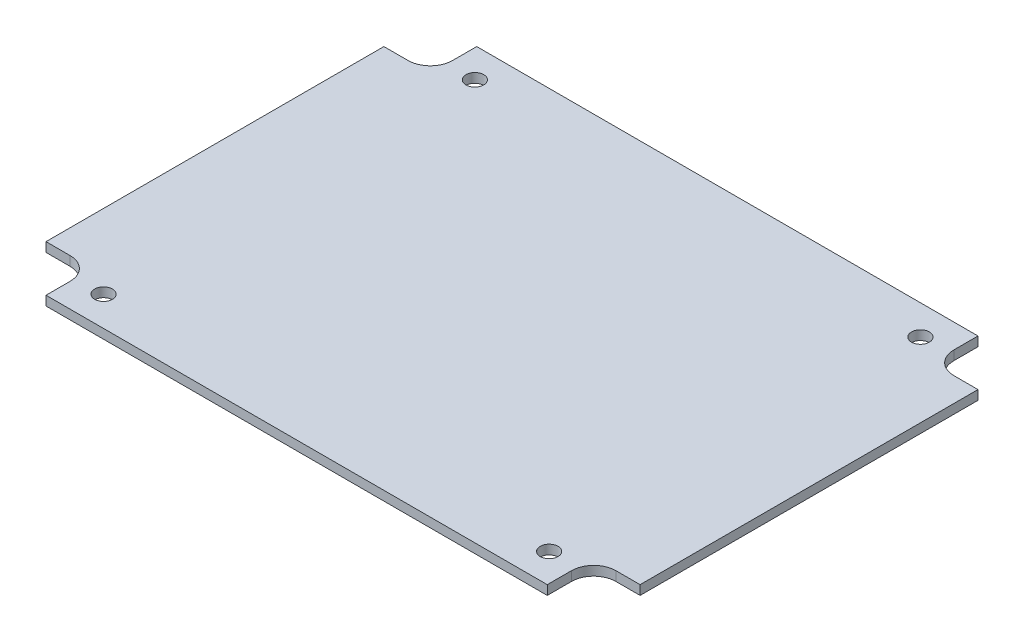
ISO-10303-21;
HEADER;
FILE_DESCRIPTION(('STEP AP214'),'2;1');
FILE_NAME('part.step','',(''),(''),'','','');
FILE_SCHEMA(('AUTOMOTIVE_DESIGN { 1 0 10303 214 1 1 1 1 }'));
ENDSEC;
DATA;
#1=APPLICATION_CONTEXT('core data for automotive mechanical design processes');
#2=APPLICATION_PROTOCOL_DEFINITION('international standard','automotive_design',2000,#1);
#3=PRODUCT_CONTEXT('',#1,'mechanical');
#4=PRODUCT('Part','Part','',(#3));
#5=PRODUCT_RELATED_PRODUCT_CATEGORY('part','',(#4));
#6=PRODUCT_DEFINITION_FORMATION('','',#4);
#7=PRODUCT_DEFINITION_CONTEXT('part definition',#1,'design');
#8=PRODUCT_DEFINITION('design','',#6,#7);
#9=PRODUCT_DEFINITION_SHAPE('','',#8);
#10=(LENGTH_UNIT() NAMED_UNIT(*) SI_UNIT(.MILLI.,.METRE.));
#11=(NAMED_UNIT(*) PLANE_ANGLE_UNIT() SI_UNIT($,.RADIAN.));
#12=(NAMED_UNIT(*) SI_UNIT($,.STERADIAN.) SOLID_ANGLE_UNIT());
#13=UNCERTAINTY_MEASURE_WITH_UNIT(LENGTH_MEASURE(1.E-05),#10,'distance_accuracy_value','');
#14=(GEOMETRIC_REPRESENTATION_CONTEXT(3) GLOBAL_UNCERTAINTY_ASSIGNED_CONTEXT((#13)) GLOBAL_UNIT_ASSIGNED_CONTEXT((#10,
#11,#12)) REPRESENTATION_CONTEXT('',''));
#15=CARTESIAN_POINT('',(0.,0.,0.));
#16=DIRECTION('',(0.,0.,1.));
#17=DIRECTION('',(1.,0.,0.));
#18=AXIS2_PLACEMENT_3D('',#15,#16,#17);
#19=CARTESIAN_POINT('',(0.,1.6002,-73.66));
#20=DIRECTION('',(0.,0.,1.));
#21=DIRECTION('',(1.,0.,0.));
#22=AXIS2_PLACEMENT_3D('',#19,#20,#21);
#23=PLANE('',#22);
#24=DIRECTION('',(-1.,0.,0.));
#25=VECTOR('',#24,1.);
#26=CARTESIAN_POINT('',(0.,0.,-73.66));
#27=LINE('',#26,#25);
#28=CARTESIAN_POINT('',(93.6625,0.,-73.66));
#29=VERTEX_POINT('',#28);
#30=CARTESIAN_POINT('',(7.93749999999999,0.,-73.66));
#31=VERTEX_POINT('',#30);
#32=EDGE_CURVE('E252',#29,#31,#27,.T.);
#33=ORIENTED_EDGE('',*,*,#32,.T.);
#34=DIRECTION('',(0.,1.,0.));
#35=VECTOR('',#34,1.);
#36=CARTESIAN_POINT('',(7.93749999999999,0.,-73.66));
#37=LINE('',#36,#35);
#38=CARTESIAN_POINT('',(7.93749999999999,1.6002,-73.66));
#39=VERTEX_POINT('',#38);
#40=EDGE_CURVE('E53',#31,#39,#37,.T.);
#41=ORIENTED_EDGE('',*,*,#40,.T.);
#42=DIRECTION('',(-1.,0.,0.));
#43=VECTOR('',#42,1.);
#44=CARTESIAN_POINT('',(0.,1.6002,-73.66));
#45=LINE('',#44,#43);
#46=CARTESIAN_POINT('',(93.6625,1.6002,-73.66));
#47=VERTEX_POINT('',#46);
#48=EDGE_CURVE('E268',#47,#39,#45,.T.);
#49=ORIENTED_EDGE('',*,*,#48,.F.);
#50=DIRECTION('',(0.,1.,0.));
#51=VECTOR('',#50,1.);
#52=CARTESIAN_POINT('',(93.6625,0.,-73.66));
#53=LINE('',#52,#51);
#54=EDGE_CURVE('E225',#29,#47,#53,.T.);
#55=ORIENTED_EDGE('',*,*,#54,.F.);
#56=EDGE_LOOP('',(#33,#41,#49,#55));
#57=FACE_BOUND('',#56,.T.);
#58=ADVANCED_FACE('F31',(#57),#23,.F.);
#59=CARTESIAN_POINT('',(0.,1.6002,0.));
#60=DIRECTION('',(1.,0.,0.));
#61=DIRECTION('',(0.,0.,-1.));
#62=AXIS2_PLACEMENT_3D('',#59,#60,#61);
#63=PLANE('',#62);
#64=DIRECTION('',(0.,0.,1.));
#65=VECTOR('',#64,1.);
#66=CARTESIAN_POINT('',(0.,0.,0.));
#67=LINE('',#66,#65);
#68=CARTESIAN_POINT('',(0.,0.,-65.7225));
#69=VERTEX_POINT('',#68);
#70=CARTESIAN_POINT('',(0.,0.,-7.93749999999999));
#71=VERTEX_POINT('',#70);
#72=EDGE_CURVE('E260',#69,#71,#67,.T.);
#73=ORIENTED_EDGE('',*,*,#72,.T.);
#74=DIRECTION('',(0.,1.,0.));
#75=VECTOR('',#74,1.);
#76=CARTESIAN_POINT('',(0.,0.,-7.93749999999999));
#77=LINE('',#76,#75);
#78=CARTESIAN_POINT('',(0.,1.6002,-7.93749999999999));
#79=VERTEX_POINT('',#78);
#80=EDGE_CURVE('E45',#71,#79,#77,.T.);
#81=ORIENTED_EDGE('',*,*,#80,.T.);
#82=DIRECTION('',(0.,0.,1.));
#83=VECTOR('',#82,1.);
#84=CARTESIAN_POINT('',(0.,1.6002,0.));
#85=LINE('',#84,#83);
#86=CARTESIAN_POINT('',(0.,1.6002,-65.7225));
#87=VERTEX_POINT('',#86);
#88=EDGE_CURVE('E166',#87,#79,#85,.T.);
#89=ORIENTED_EDGE('',*,*,#88,.F.);
#90=DIRECTION('',(0.,1.,0.));
#91=VECTOR('',#90,1.);
#92=CARTESIAN_POINT('',(0.,0.,-65.7225));
#93=LINE('',#92,#91);
#94=EDGE_CURVE('E201',#69,#87,#93,.T.);
#95=ORIENTED_EDGE('',*,*,#94,.F.);
#96=EDGE_LOOP('',(#73,#81,#89,#95));
#97=FACE_BOUND('',#96,.T.);
#98=ADVANCED_FACE('F318',(#97),#63,.F.);
#99=CARTESIAN_POINT('',(0.,1.6002,0.));
#100=DIRECTION('',(0.,0.,-1.));
#101=DIRECTION('',(-1.,0.,0.));
#102=AXIS2_PLACEMENT_3D('',#99,#100,#101);
#103=PLANE('',#102);
#104=DIRECTION('',(1.,0.,0.));
#105=VECTOR('',#104,1.);
#106=CARTESIAN_POINT('',(0.,1.6002,0.));
#107=LINE('',#106,#105);
#108=CARTESIAN_POINT('',(7.9375,1.6002,0.));
#109=VERTEX_POINT('',#108);
#110=CARTESIAN_POINT('',(93.6625,1.6002,0.));
#111=VERTEX_POINT('',#110);
#112=EDGE_CURVE('E38',#109,#111,#107,.T.);
#113=ORIENTED_EDGE('',*,*,#112,.F.);
#114=DIRECTION('',(0.,1.,0.));
#115=VECTOR('',#114,1.);
#116=CARTESIAN_POINT('',(7.9375,0.,0.));
#117=LINE('',#116,#115);
#118=CARTESIAN_POINT('',(7.9375,0.,0.));
#119=VERTEX_POINT('',#118);
#120=EDGE_CURVE('E179',#119,#109,#117,.T.);
#121=ORIENTED_EDGE('',*,*,#120,.F.);
#122=DIRECTION('',(1.,0.,0.));
#123=VECTOR('',#122,1.);
#124=CARTESIAN_POINT('',(0.,0.,0.));
#125=LINE('',#124,#123);
#126=CARTESIAN_POINT('',(93.6625,0.,0.));
#127=VERTEX_POINT('',#126);
#128=EDGE_CURVE('E263',#119,#127,#125,.T.);
#129=ORIENTED_EDGE('',*,*,#128,.T.);
#130=DIRECTION('',(0.,1.,0.));
#131=VECTOR('',#130,1.);
#132=CARTESIAN_POINT('',(93.6625,0.,0.));
#133=LINE('',#132,#131);
#134=EDGE_CURVE('E249',#127,#111,#133,.T.);
#135=ORIENTED_EDGE('',*,*,#134,.T.);
#136=EDGE_LOOP('',(#113,#121,#129,#135));
#137=FACE_BOUND('',#136,.T.);
#138=ADVANCED_FACE('F280',(#137),#103,.F.);
#139=CARTESIAN_POINT('',(101.6,1.6002,0.));
#140=DIRECTION('',(-1.,0.,0.));
#141=DIRECTION('',(0.,0.,1.));
#142=AXIS2_PLACEMENT_3D('',#139,#140,#141);
#143=PLANE('',#142);
#144=DIRECTION('',(0.,0.,-1.));
#145=VECTOR('',#144,1.);
#146=CARTESIAN_POINT('',(101.6,0.,0.));
#147=LINE('',#146,#145);
#148=CARTESIAN_POINT('',(101.6,0.,-7.9375));
#149=VERTEX_POINT('',#148);
#150=CARTESIAN_POINT('',(101.6,0.,-65.7225));
#151=VERTEX_POINT('',#150);
#152=EDGE_CURVE('E265',#149,#151,#147,.T.);
#153=ORIENTED_EDGE('',*,*,#152,.T.);
#154=DIRECTION('',(0.,1.,0.));
#155=VECTOR('',#154,1.);
#156=CARTESIAN_POINT('',(101.6,0.,-65.7225));
#157=LINE('',#156,#155);
#158=CARTESIAN_POINT('',(101.6,1.6002,-65.7225));
#159=VERTEX_POINT('',#158);
#160=EDGE_CURVE('E227',#151,#159,#157,.T.);
#161=ORIENTED_EDGE('',*,*,#160,.T.);
#162=DIRECTION('',(0.,0.,-1.));
#163=VECTOR('',#162,1.);
#164=CARTESIAN_POINT('',(101.6,1.6002,0.));
#165=LINE('',#164,#163);
#166=CARTESIAN_POINT('',(101.6,1.6002,-7.9375));
#167=VERTEX_POINT('',#166);
#168=EDGE_CURVE('E11',#167,#159,#165,.T.);
#169=ORIENTED_EDGE('',*,*,#168,.F.);
#170=DIRECTION('',(0.,1.,0.));
#171=VECTOR('',#170,1.);
#172=CARTESIAN_POINT('',(101.6,0.,-7.9375));
#173=LINE('',#172,#171);
#174=EDGE_CURVE('E248',#149,#167,#173,.T.);
#175=ORIENTED_EDGE('',*,*,#174,.F.);
#176=EDGE_LOOP('',(#153,#161,#169,#175));
#177=FACE_BOUND('',#176,.T.);
#178=ADVANCED_FACE('F295',(#177),#143,.F.);
#179=CARTESIAN_POINT('',(0.,1.6002,-73.66));
#180=DIRECTION('',(0.,1.,0.));
#181=DIRECTION('',(0.,0.,1.));
#182=AXIS2_PLACEMENT_3D('',#179,#180,#181);
#183=PLANE('',#182);
#184=CARTESIAN_POINT('',(12.7,1.6002,-5.07999999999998));
#185=DIRECTION('',(0.,1.,0.));
#186=DIRECTION('',(0.,0.,-1.));
#187=AXIS2_PLACEMENT_3D('',#184,#185,#186);
#188=CIRCLE('',#187,1.52399999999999);
#189=CARTESIAN_POINT('',(12.7,1.6002,-6.60399999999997));
#190=VERTEX_POINT('',#189);
#191=EDGE_CURVE('E470',#190,#190,#188,.T.);
#192=ORIENTED_EDGE('',*,*,#191,.F.);
#193=EDGE_LOOP('',(#192));
#194=FACE_BOUND('',#193,.T.);
#195=CARTESIAN_POINT('',(12.7,1.6002,-68.58));
#196=DIRECTION('',(0.,1.,0.));
#197=DIRECTION('',(0.,0.,1.));
#198=AXIS2_PLACEMENT_3D('',#195,#196,#197);
#199=CIRCLE('',#198,1.52399999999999);
#200=CARTESIAN_POINT('',(12.7,1.6002,-67.056));
#201=VERTEX_POINT('',#200);
#202=EDGE_CURVE('E472',#201,#201,#199,.T.);
#203=ORIENTED_EDGE('',*,*,#202,.F.);
#204=EDGE_LOOP('',(#203));
#205=FACE_BOUND('',#204,.T.);
#206=CARTESIAN_POINT('',(88.9,1.6002,-68.58));
#207=DIRECTION('',(0.,1.,0.));
#208=DIRECTION('',(0.,0.,-1.));
#209=AXIS2_PLACEMENT_3D('',#206,#207,#208);
#210=CIRCLE('',#209,1.52399999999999);
#211=CARTESIAN_POINT('',(88.9,1.6002,-70.104));
#212=VERTEX_POINT('',#211);
#213=EDGE_CURVE('E478',#212,#212,#210,.T.);
#214=ORIENTED_EDGE('',*,*,#213,.F.);
#215=EDGE_LOOP('',(#214));
#216=FACE_BOUND('',#215,.T.);
#217=CARTESIAN_POINT('',(88.9,1.6002,-5.07999999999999));
#218=DIRECTION('',(0.,1.,0.));
#219=DIRECTION('',(0.,0.,1.));
#220=AXIS2_PLACEMENT_3D('',#217,#218,#219);
#221=CIRCLE('',#220,1.52399999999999);
#222=CARTESIAN_POINT('',(88.9,1.6002,-3.556));
#223=VERTEX_POINT('',#222);
#224=EDGE_CURVE('E484',#223,#223,#221,.T.);
#225=ORIENTED_EDGE('',*,*,#224,.F.);
#226=EDGE_LOOP('',(#225));
#227=FACE_BOUND('',#226,.T.);
#228=DIRECTION('',(0.,0.,-1.));
#229=VECTOR('',#228,1.);
#230=CARTESIAN_POINT('',(7.9375,1.6002,0.));
#231=LINE('',#230,#229);
#232=CARTESIAN_POINT('',(7.9375,1.6002,-4.12749999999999));
#233=VERTEX_POINT('',#232);
#234=EDGE_CURVE('E167',#109,#233,#231,.T.);
#235=ORIENTED_EDGE('',*,*,#234,.F.);
#236=ORIENTED_EDGE('',*,*,#112,.T.);
#237=DIRECTION('',(0.,0.,1.));
#238=VECTOR('',#237,1.);
#239=CARTESIAN_POINT('',(93.6625,1.6002,0.));
#240=LINE('',#239,#238);
#241=CARTESIAN_POINT('',(93.6625,1.6002,-4.1275));
#242=VERTEX_POINT('',#241);
#243=EDGE_CURVE('E236',#242,#111,#240,.T.);
#244=ORIENTED_EDGE('',*,*,#243,.F.);
#245=CARTESIAN_POINT('',(97.4725,1.6002,-4.1275));
#246=DIRECTION('',(0.,1.,0.));
#247=DIRECTION('',(0.,0.,1.));
#248=AXIS2_PLACEMENT_3D('',#245,#246,#247);
#249=CIRCLE('',#248,3.81);
#250=CARTESIAN_POINT('',(97.4725,1.6002,-7.9375));
#251=VERTEX_POINT('',#250);
#252=EDGE_CURVE('E233',#251,#242,#249,.T.);
#253=ORIENTED_EDGE('',*,*,#252,.F.);
#254=DIRECTION('',(-1.,0.,0.));
#255=VECTOR('',#254,1.);
#256=CARTESIAN_POINT('',(101.6,1.6002,-7.9375));
#257=LINE('',#256,#255);
#258=EDGE_CURVE('E224',#167,#251,#257,.T.);
#259=ORIENTED_EDGE('',*,*,#258,.F.);
#260=ORIENTED_EDGE('',*,*,#168,.T.);
#261=DIRECTION('',(1.,0.,0.));
#262=VECTOR('',#261,1.);
#263=CARTESIAN_POINT('',(101.6,1.6002,-65.7225));
#264=LINE('',#263,#262);
#265=CARTESIAN_POINT('',(97.4725,1.6002,-65.7225));
#266=VERTEX_POINT('',#265);
#267=EDGE_CURVE('E207',#266,#159,#264,.T.);
#268=ORIENTED_EDGE('',*,*,#267,.F.);
#269=CARTESIAN_POINT('',(97.4725,1.6002,-69.5325));
#270=DIRECTION('',(0.,1.,0.));
#271=DIRECTION('',(0.,0.,-1.));
#272=AXIS2_PLACEMENT_3D('',#269,#270,#271);
#273=CIRCLE('',#272,3.81);
#274=CARTESIAN_POINT('',(93.6625,1.6002,-69.5325));
#275=VERTEX_POINT('',#274);
#276=EDGE_CURVE('E200',#275,#266,#273,.T.);
#277=ORIENTED_EDGE('',*,*,#276,.F.);
#278=DIRECTION('',(0.,0.,1.));
#279=VECTOR('',#278,1.);
#280=CARTESIAN_POINT('',(93.6625,1.6002,-73.66));
#281=LINE('',#280,#279);
#282=EDGE_CURVE('E209',#47,#275,#281,.T.);
#283=ORIENTED_EDGE('',*,*,#282,.F.);
#284=ORIENTED_EDGE('',*,*,#48,.T.);
#285=DIRECTION('',(0.,0.,-1.));
#286=VECTOR('',#285,1.);
#287=CARTESIAN_POINT('',(7.93749999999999,1.6002,-73.66));
#288=LINE('',#287,#286);
#289=CARTESIAN_POINT('',(7.93749999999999,1.6002,-69.5325));
#290=VERTEX_POINT('',#289);
#291=EDGE_CURVE('E184',#290,#39,#288,.T.);
#292=ORIENTED_EDGE('',*,*,#291,.F.);
#293=CARTESIAN_POINT('',(4.12749999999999,1.6002,-69.5325));
#294=DIRECTION('',(0.,1.,0.));
#295=DIRECTION('',(0.,0.,1.));
#296=AXIS2_PLACEMENT_3D('',#293,#294,#295);
#297=CIRCLE('',#296,3.81);
#298=CARTESIAN_POINT('',(4.12749999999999,1.6002,-65.7225));
#299=VERTEX_POINT('',#298);
#300=EDGE_CURVE('E178',#299,#290,#297,.T.);
#301=ORIENTED_EDGE('',*,*,#300,.F.);
#302=DIRECTION('',(1.,0.,0.));
#303=VECTOR('',#302,1.);
#304=CARTESIAN_POINT('',(0.,1.6002,-65.7225));
#305=LINE('',#304,#303);
#306=EDGE_CURVE('E186',#87,#299,#305,.T.);
#307=ORIENTED_EDGE('',*,*,#306,.F.);
#308=ORIENTED_EDGE('',*,*,#88,.T.);
#309=DIRECTION('',(-1.,0.,0.));
#310=VECTOR('',#309,1.);
#311=CARTESIAN_POINT('',(0.,1.6002,-7.93749999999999));
#312=LINE('',#311,#310);
#313=CARTESIAN_POINT('',(4.12750000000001,1.6002,-7.93749999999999));
#314=VERTEX_POINT('',#313);
#315=EDGE_CURVE('E146',#314,#79,#312,.T.);
#316=ORIENTED_EDGE('',*,*,#315,.F.);
#317=CARTESIAN_POINT('',(4.12750000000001,1.6002,-4.12749999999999));
#318=DIRECTION('',(0.,1.,0.));
#319=DIRECTION('',(0.,0.,-1.));
#320=AXIS2_PLACEMENT_3D('',#317,#318,#319);
#321=CIRCLE('',#320,3.80999999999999);
#322=EDGE_CURVE('E154',#233,#314,#321,.T.);
#323=ORIENTED_EDGE('',*,*,#322,.F.);
#324=EDGE_LOOP('',(#235,#236,#244,#253,#259,#260,#268,#277,#283,#284,#292,#301,#307,#308,#316,#323));
#325=FACE_BOUND('',#324,.T.);
#326=ADVANCED_FACE('F163',(#194,#205,#216,#227,#325),#183,.T.);
#327=CARTESIAN_POINT('',(0.,0.,-73.66));
#328=DIRECTION('',(0.,1.,0.));
#329=DIRECTION('',(0.,0.,1.));
#330=AXIS2_PLACEMENT_3D('',#327,#328,#329);
#331=PLANE('',#330);
#332=CARTESIAN_POINT('',(12.7,0.,-5.07999999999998));
#333=DIRECTION('',(0.,1.,0.));
#334=DIRECTION('',(0.,0.,-1.));
#335=AXIS2_PLACEMENT_3D('',#332,#333,#334);
#336=CIRCLE('',#335,1.52399999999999);
#337=CARTESIAN_POINT('',(12.7,0.,-6.60399999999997));
#338=VERTEX_POINT('',#337);
#339=EDGE_CURVE('E467',#338,#338,#336,.T.);
#340=ORIENTED_EDGE('',*,*,#339,.T.);
#341=EDGE_LOOP('',(#340));
#342=FACE_BOUND('',#341,.T.);
#343=CARTESIAN_POINT('',(12.7,0.,-68.58));
#344=DIRECTION('',(0.,1.,0.));
#345=DIRECTION('',(0.,0.,1.));
#346=AXIS2_PLACEMENT_3D('',#343,#344,#345);
#347=CIRCLE('',#346,1.52399999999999);
#348=CARTESIAN_POINT('',(12.7,0.,-67.056));
#349=VERTEX_POINT('',#348);
#350=EDGE_CURVE('E475',#349,#349,#347,.T.);
#351=ORIENTED_EDGE('',*,*,#350,.T.);
#352=EDGE_LOOP('',(#351));
#353=FACE_BOUND('',#352,.T.);
#354=CARTESIAN_POINT('',(88.9,0.,-68.58));
#355=DIRECTION('',(0.,1.,0.));
#356=DIRECTION('',(0.,0.,-1.));
#357=AXIS2_PLACEMENT_3D('',#354,#355,#356);
#358=CIRCLE('',#357,1.52399999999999);
#359=CARTESIAN_POINT('',(88.9,0.,-70.104));
#360=VERTEX_POINT('',#359);
#361=EDGE_CURVE('E481',#360,#360,#358,.T.);
#362=ORIENTED_EDGE('',*,*,#361,.T.);
#363=EDGE_LOOP('',(#362));
#364=FACE_BOUND('',#363,.T.);
#365=CARTESIAN_POINT('',(88.9,0.,-5.07999999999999));
#366=DIRECTION('',(0.,1.,0.));
#367=DIRECTION('',(0.,0.,1.));
#368=AXIS2_PLACEMENT_3D('',#365,#366,#367);
#369=CIRCLE('',#368,1.52399999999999);
#370=CARTESIAN_POINT('',(88.9,0.,-3.556));
#371=VERTEX_POINT('',#370);
#372=EDGE_CURVE('E160',#371,#371,#369,.T.);
#373=ORIENTED_EDGE('',*,*,#372,.T.);
#374=EDGE_LOOP('',(#373));
#375=FACE_BOUND('',#374,.T.);
#376=ORIENTED_EDGE('',*,*,#128,.F.);
#377=DIRECTION('',(0.,0.,-1.));
#378=VECTOR('',#377,1.);
#379=CARTESIAN_POINT('',(7.9375,0.,0.));
#380=LINE('',#379,#378);
#381=CARTESIAN_POINT('',(7.9375,0.,-4.12749999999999));
#382=VERTEX_POINT('',#381);
#383=EDGE_CURVE('E151',#119,#382,#380,.T.);
#384=ORIENTED_EDGE('',*,*,#383,.T.);
#385=CARTESIAN_POINT('',(4.12750000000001,0.,-4.12749999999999));
#386=DIRECTION('',(0.,1.,0.));
#387=DIRECTION('',(0.,0.,-1.));
#388=AXIS2_PLACEMENT_3D('',#385,#386,#387);
#389=CIRCLE('',#388,3.80999999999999);
#390=CARTESIAN_POINT('',(4.12750000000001,0.,-7.93749999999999));
#391=VERTEX_POINT('',#390);
#392=EDGE_CURVE('E169',#382,#391,#389,.T.);
#393=ORIENTED_EDGE('',*,*,#392,.T.);
#394=DIRECTION('',(-1.,0.,0.));
#395=VECTOR('',#394,1.);
#396=CARTESIAN_POINT('',(0.,0.,-7.93749999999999));
#397=LINE('',#396,#395);
#398=EDGE_CURVE('E147',#391,#71,#397,.T.);
#399=ORIENTED_EDGE('',*,*,#398,.T.);
#400=ORIENTED_EDGE('',*,*,#72,.F.);
#401=DIRECTION('',(1.,0.,0.));
#402=VECTOR('',#401,1.);
#403=CARTESIAN_POINT('',(0.,0.,-65.7225));
#404=LINE('',#403,#402);
#405=CARTESIAN_POINT('',(4.12749999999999,0.,-65.7225));
#406=VERTEX_POINT('',#405);
#407=EDGE_CURVE('E194',#69,#406,#404,.T.);
#408=ORIENTED_EDGE('',*,*,#407,.T.);
#409=CARTESIAN_POINT('',(4.12749999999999,0.,-69.5325));
#410=DIRECTION('',(0.,1.,0.));
#411=DIRECTION('',(0.,0.,1.));
#412=AXIS2_PLACEMENT_3D('',#409,#410,#411);
#413=CIRCLE('',#412,3.81);
#414=CARTESIAN_POINT('',(7.93749999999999,0.,-69.5325));
#415=VERTEX_POINT('',#414);
#416=EDGE_CURVE('E189',#406,#415,#413,.T.);
#417=ORIENTED_EDGE('',*,*,#416,.T.);
#418=DIRECTION('',(0.,0.,-1.));
#419=VECTOR('',#418,1.);
#420=CARTESIAN_POINT('',(7.93749999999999,0.,-73.66));
#421=LINE('',#420,#419);
#422=EDGE_CURVE('E192',#415,#31,#421,.T.);
#423=ORIENTED_EDGE('',*,*,#422,.T.);
#424=ORIENTED_EDGE('',*,*,#32,.F.);
#425=DIRECTION('',(0.,0.,1.));
#426=VECTOR('',#425,1.);
#427=CARTESIAN_POINT('',(93.6625,0.,-73.66));
#428=LINE('',#427,#426);
#429=CARTESIAN_POINT('',(93.6625,0.,-69.5325));
#430=VERTEX_POINT('',#429);
#431=EDGE_CURVE('E218',#29,#430,#428,.T.);
#432=ORIENTED_EDGE('',*,*,#431,.T.);
#433=CARTESIAN_POINT('',(97.4725,0.,-69.5325));
#434=DIRECTION('',(0.,1.,0.));
#435=DIRECTION('',(0.,0.,-1.));
#436=AXIS2_PLACEMENT_3D('',#433,#434,#435);
#437=CIRCLE('',#436,3.81);
#438=CARTESIAN_POINT('',(97.4725,0.,-65.7225));
#439=VERTEX_POINT('',#438);
#440=EDGE_CURVE('E212',#430,#439,#437,.T.);
#441=ORIENTED_EDGE('',*,*,#440,.T.);
#442=DIRECTION('',(1.,0.,0.));
#443=VECTOR('',#442,1.);
#444=CARTESIAN_POINT('',(101.6,0.,-65.7225));
#445=LINE('',#444,#443);
#446=EDGE_CURVE('E215',#439,#151,#445,.T.);
#447=ORIENTED_EDGE('',*,*,#446,.T.);
#448=ORIENTED_EDGE('',*,*,#152,.F.);
#449=DIRECTION('',(-1.,0.,0.));
#450=VECTOR('',#449,1.);
#451=CARTESIAN_POINT('',(101.6,0.,-7.9375));
#452=LINE('',#451,#450);
#453=CARTESIAN_POINT('',(97.4725,0.,-7.9375));
#454=VERTEX_POINT('',#453);
#455=EDGE_CURVE('E239',#149,#454,#452,.T.);
#456=ORIENTED_EDGE('',*,*,#455,.T.);
#457=CARTESIAN_POINT('',(97.4725,0.,-4.1275));
#458=DIRECTION('',(0.,1.,0.));
#459=DIRECTION('',(0.,0.,1.));
#460=AXIS2_PLACEMENT_3D('',#457,#458,#459);
#461=CIRCLE('',#460,3.81);
#462=CARTESIAN_POINT('',(93.6625,0.,-4.1275));
#463=VERTEX_POINT('',#462);
#464=EDGE_CURVE('E242',#454,#463,#461,.T.);
#465=ORIENTED_EDGE('',*,*,#464,.T.);
#466=DIRECTION('',(0.,0.,1.));
#467=VECTOR('',#466,1.);
#468=CARTESIAN_POINT('',(93.6625,0.,0.));
#469=LINE('',#468,#467);
#470=EDGE_CURVE('E245',#463,#127,#469,.T.);
#471=ORIENTED_EDGE('',*,*,#470,.T.);
#472=EDGE_LOOP('',(#376,#384,#393,#399,#400,#408,#417,#423,#424,#432,#441,#447,#448,#456,#465,#471));
#473=FACE_BOUND('',#472,.T.);
#474=ADVANCED_FACE('F283',(#342,#353,#364,#375,#473),#331,.F.);
#475=CARTESIAN_POINT('',(93.6625,0.,0.));
#476=DIRECTION('',(-1.,0.,0.));
#477=DIRECTION('',(0.,0.,1.));
#478=AXIS2_PLACEMENT_3D('',#475,#476,#477);
#479=PLANE('',#478);
#480=ORIENTED_EDGE('',*,*,#243,.T.);
#481=ORIENTED_EDGE('',*,*,#134,.F.);
#482=ORIENTED_EDGE('',*,*,#470,.F.);
#483=DIRECTION('',(0.,1.,0.));
#484=VECTOR('',#483,1.);
#485=CARTESIAN_POINT('',(93.6625,0.,-4.1275));
#486=LINE('',#485,#484);
#487=EDGE_CURVE('E253',#463,#242,#486,.T.);
#488=ORIENTED_EDGE('',*,*,#487,.T.);
#489=EDGE_LOOP('',(#480,#481,#482,#488));
#490=FACE_BOUND('',#489,.T.);
#491=ADVANCED_FACE('F278',(#490),#479,.F.);
#492=CARTESIAN_POINT('',(97.4725,0.,-4.1275));
#493=DIRECTION('',(0.,1.,0.));
#494=DIRECTION('',(0.,0.,1.));
#495=AXIS2_PLACEMENT_3D('',#492,#493,#494);
#496=CYLINDRICAL_SURFACE('',#495,3.81);
#497=ORIENTED_EDGE('',*,*,#252,.T.);
#498=ORIENTED_EDGE('',*,*,#487,.F.);
#499=ORIENTED_EDGE('',*,*,#464,.F.);
#500=DIRECTION('',(0.,1.,0.));
#501=VECTOR('',#500,1.);
#502=CARTESIAN_POINT('',(97.4725,0.,-7.9375));
#503=LINE('',#502,#501);
#504=EDGE_CURVE('E255',#454,#251,#503,.T.);
#505=ORIENTED_EDGE('',*,*,#504,.T.);
#506=EDGE_LOOP('',(#497,#498,#499,#505));
#507=FACE_BOUND('',#506,.T.);
#508=ADVANCED_FACE('F287',(#507),#496,.F.);
#509=CARTESIAN_POINT('',(101.6,0.,-7.9375));
#510=DIRECTION('',(0.,0.,-1.));
#511=DIRECTION('',(-1.,0.,0.));
#512=AXIS2_PLACEMENT_3D('',#509,#510,#511);
#513=PLANE('',#512);
#514=ORIENTED_EDGE('',*,*,#258,.T.);
#515=ORIENTED_EDGE('',*,*,#504,.F.);
#516=ORIENTED_EDGE('',*,*,#455,.F.);
#517=ORIENTED_EDGE('',*,*,#174,.T.);
#518=EDGE_LOOP('',(#514,#515,#516,#517));
#519=FACE_BOUND('',#518,.T.);
#520=ADVANCED_FACE('F289',(#519),#513,.F.);
#521=CARTESIAN_POINT('',(97.4725,0.,-69.5325));
#522=DIRECTION('',(0.,1.,0.));
#523=DIRECTION('',(0.,0.,1.));
#524=AXIS2_PLACEMENT_3D('',#521,#522,#523);
#525=CYLINDRICAL_SURFACE('',#524,3.81);
#526=ORIENTED_EDGE('',*,*,#276,.T.);
#527=DIRECTION('',(0.,1.,0.));
#528=VECTOR('',#527,1.);
#529=CARTESIAN_POINT('',(97.4725,0.,-65.7225));
#530=LINE('',#529,#528);
#531=EDGE_CURVE('E221',#439,#266,#530,.T.);
#532=ORIENTED_EDGE('',*,*,#531,.F.);
#533=ORIENTED_EDGE('',*,*,#440,.F.);
#534=DIRECTION('',(0.,1.,0.));
#535=VECTOR('',#534,1.);
#536=CARTESIAN_POINT('',(93.6625,0.,-69.5325));
#537=LINE('',#536,#535);
#538=EDGE_CURVE('E222',#430,#275,#537,.T.);
#539=ORIENTED_EDGE('',*,*,#538,.T.);
#540=EDGE_LOOP('',(#526,#532,#533,#539));
#541=FACE_BOUND('',#540,.T.);
#542=ADVANCED_FACE('F302',(#541),#525,.F.);
#543=CARTESIAN_POINT('',(93.6625,0.,-73.66));
#544=DIRECTION('',(-1.,0.,0.));
#545=DIRECTION('',(0.,0.,1.));
#546=AXIS2_PLACEMENT_3D('',#543,#544,#545);
#547=PLANE('',#546);
#548=ORIENTED_EDGE('',*,*,#282,.T.);
#549=ORIENTED_EDGE('',*,*,#538,.F.);
#550=ORIENTED_EDGE('',*,*,#431,.F.);
#551=ORIENTED_EDGE('',*,*,#54,.T.);
#552=EDGE_LOOP('',(#548,#549,#550,#551));
#553=FACE_BOUND('',#552,.T.);
#554=ADVANCED_FACE('F355',(#553),#547,.F.);
#555=CARTESIAN_POINT('',(101.6,0.,-65.7225));
#556=DIRECTION('',(0.,0.,1.));
#557=DIRECTION('',(1.,0.,0.));
#558=AXIS2_PLACEMENT_3D('',#555,#556,#557);
#559=PLANE('',#558);
#560=ORIENTED_EDGE('',*,*,#267,.T.);
#561=ORIENTED_EDGE('',*,*,#160,.F.);
#562=ORIENTED_EDGE('',*,*,#446,.F.);
#563=ORIENTED_EDGE('',*,*,#531,.T.);
#564=EDGE_LOOP('',(#560,#561,#562,#563));
#565=FACE_BOUND('',#564,.T.);
#566=ADVANCED_FACE('F298',(#565),#559,.F.);
#567=CARTESIAN_POINT('',(4.12749999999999,0.,-69.5325));
#568=DIRECTION('',(0.,1.,0.));
#569=DIRECTION('',(0.,0.,1.));
#570=AXIS2_PLACEMENT_3D('',#567,#568,#569);
#571=CYLINDRICAL_SURFACE('',#570,3.81);
#572=ORIENTED_EDGE('',*,*,#300,.T.);
#573=DIRECTION('',(0.,1.,0.));
#574=VECTOR('',#573,1.);
#575=CARTESIAN_POINT('',(7.93749999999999,0.,-69.5325));
#576=LINE('',#575,#574);
#577=EDGE_CURVE('E197',#415,#290,#576,.T.);
#578=ORIENTED_EDGE('',*,*,#577,.F.);
#579=ORIENTED_EDGE('',*,*,#416,.F.);
#580=DIRECTION('',(0.,1.,0.));
#581=VECTOR('',#580,1.);
#582=CARTESIAN_POINT('',(4.12749999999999,0.,-65.7225));
#583=LINE('',#582,#581);
#584=EDGE_CURVE('E198',#406,#299,#583,.T.);
#585=ORIENTED_EDGE('',*,*,#584,.T.);
#586=EDGE_LOOP('',(#572,#578,#579,#585));
#587=FACE_BOUND('',#586,.T.);
#588=ADVANCED_FACE('F314',(#587),#571,.F.);
#589=CARTESIAN_POINT('',(0.,0.,-65.7225));
#590=DIRECTION('',(0.,0.,1.));
#591=DIRECTION('',(1.,0.,0.));
#592=AXIS2_PLACEMENT_3D('',#589,#590,#591);
#593=PLANE('',#592);
#594=ORIENTED_EDGE('',*,*,#306,.T.);
#595=ORIENTED_EDGE('',*,*,#584,.F.);
#596=ORIENTED_EDGE('',*,*,#407,.F.);
#597=ORIENTED_EDGE('',*,*,#94,.T.);
#598=EDGE_LOOP('',(#594,#595,#596,#597));
#599=FACE_BOUND('',#598,.T.);
#600=ADVANCED_FACE('F320',(#599),#593,.F.);
#601=CARTESIAN_POINT('',(7.93749999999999,0.,-73.66));
#602=DIRECTION('',(1.,0.,0.));
#603=DIRECTION('',(0.,0.,-1.));
#604=AXIS2_PLACEMENT_3D('',#601,#602,#603);
#605=PLANE('',#604);
#606=ORIENTED_EDGE('',*,*,#291,.T.);
#607=ORIENTED_EDGE('',*,*,#40,.F.);
#608=ORIENTED_EDGE('',*,*,#422,.F.);
#609=ORIENTED_EDGE('',*,*,#577,.T.);
#610=EDGE_LOOP('',(#606,#607,#608,#609));
#611=FACE_BOUND('',#610,.T.);
#612=ADVANCED_FACE('F311',(#611),#605,.F.);
#613=CARTESIAN_POINT('',(4.12750000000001,0.,-4.12749999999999));
#614=DIRECTION('',(0.,1.,0.));
#615=DIRECTION('',(0.,0.,1.));
#616=AXIS2_PLACEMENT_3D('',#613,#614,#615);
#617=CYLINDRICAL_SURFACE('',#616,3.80999999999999);
#618=ORIENTED_EDGE('',*,*,#322,.T.);
#619=DIRECTION('',(0.,1.,0.));
#620=VECTOR('',#619,1.);
#621=CARTESIAN_POINT('',(4.12750000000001,0.,-7.93749999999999));
#622=LINE('',#621,#620);
#623=EDGE_CURVE('E142',#391,#314,#622,.T.);
#624=ORIENTED_EDGE('',*,*,#623,.F.);
#625=ORIENTED_EDGE('',*,*,#392,.F.);
#626=DIRECTION('',(0.,1.,0.));
#627=VECTOR('',#626,1.);
#628=CARTESIAN_POINT('',(7.9375,0.,-4.12749999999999));
#629=LINE('',#628,#627);
#630=EDGE_CURVE('E156',#382,#233,#629,.T.);
#631=ORIENTED_EDGE('',*,*,#630,.T.);
#632=EDGE_LOOP('',(#618,#624,#625,#631));
#633=FACE_BOUND('',#632,.T.);
#634=ADVANCED_FACE('F155',(#633),#617,.F.);
#635=CARTESIAN_POINT('',(7.9375,0.,0.));
#636=DIRECTION('',(1.,0.,0.));
#637=DIRECTION('',(0.,0.,-1.));
#638=AXIS2_PLACEMENT_3D('',#635,#636,#637);
#639=PLANE('',#638);
#640=ORIENTED_EDGE('',*,*,#234,.T.);
#641=ORIENTED_EDGE('',*,*,#630,.F.);
#642=ORIENTED_EDGE('',*,*,#383,.F.);
#643=ORIENTED_EDGE('',*,*,#120,.T.);
#644=EDGE_LOOP('',(#640,#641,#642,#643));
#645=FACE_BOUND('',#644,.T.);
#646=ADVANCED_FACE('F390',(#645),#639,.F.);
#647=CARTESIAN_POINT('',(0.,0.,-7.93749999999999));
#648=DIRECTION('',(0.,0.,-1.));
#649=DIRECTION('',(-1.,0.,0.));
#650=AXIS2_PLACEMENT_3D('',#647,#648,#649);
#651=PLANE('',#650);
#652=ORIENTED_EDGE('',*,*,#315,.T.);
#653=ORIENTED_EDGE('',*,*,#80,.F.);
#654=ORIENTED_EDGE('',*,*,#398,.F.);
#655=ORIENTED_EDGE('',*,*,#623,.T.);
#656=EDGE_LOOP('',(#652,#653,#654,#655));
#657=FACE_BOUND('',#656,.T.);
#658=ADVANCED_FACE('F144',(#657),#651,.F.);
#659=CARTESIAN_POINT('',(88.9,0.,-5.07999999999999));
#660=DIRECTION('',(0.,1.,0.));
#661=DIRECTION('',(0.,0.,1.));
#662=AXIS2_PLACEMENT_3D('',#659,#660,#661);
#663=CYLINDRICAL_SURFACE('',#662,1.52399999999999);
#664=ORIENTED_EDGE('',*,*,#372,.F.);
#665=EDGE_LOOP('',(#664));
#666=FACE_BOUND('',#665,.T.);
#667=ORIENTED_EDGE('',*,*,#224,.T.);
#668=EDGE_LOOP('',(#667));
#669=FACE_BOUND('',#668,.T.);
#670=ADVANCED_FACE('F407',(#666,#669),#663,.F.);
#671=CARTESIAN_POINT('',(88.9,0.,-68.58));
#672=DIRECTION('',(0.,1.,0.));
#673=DIRECTION('',(0.,0.,1.));
#674=AXIS2_PLACEMENT_3D('',#671,#672,#673);
#675=CYLINDRICAL_SURFACE('',#674,1.52399999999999);
#676=ORIENTED_EDGE('',*,*,#361,.F.);
#677=EDGE_LOOP('',(#676));
#678=FACE_BOUND('',#677,.T.);
#679=ORIENTED_EDGE('',*,*,#213,.T.);
#680=EDGE_LOOP('',(#679));
#681=FACE_BOUND('',#680,.T.);
#682=ADVANCED_FACE('F430',(#678,#681),#675,.F.);
#683=CARTESIAN_POINT('',(12.7,0.,-68.58));
#684=DIRECTION('',(0.,1.,0.));
#685=DIRECTION('',(0.,0.,1.));
#686=AXIS2_PLACEMENT_3D('',#683,#684,#685);
#687=CYLINDRICAL_SURFACE('',#686,1.52399999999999);
#688=ORIENTED_EDGE('',*,*,#350,.F.);
#689=EDGE_LOOP('',(#688));
#690=FACE_BOUND('',#689,.T.);
#691=ORIENTED_EDGE('',*,*,#202,.T.);
#692=EDGE_LOOP('',(#691));
#693=FACE_BOUND('',#692,.T.);
#694=ADVANCED_FACE('F440',(#690,#693),#687,.F.);
#695=CARTESIAN_POINT('',(12.7,0.,-5.07999999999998));
#696=DIRECTION('',(0.,1.,0.));
#697=DIRECTION('',(0.,0.,1.));
#698=AXIS2_PLACEMENT_3D('',#695,#696,#697);
#699=CYLINDRICAL_SURFACE('',#698,1.52399999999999);
#700=ORIENTED_EDGE('',*,*,#339,.F.);
#701=EDGE_LOOP('',(#700));
#702=FACE_BOUND('',#701,.T.);
#703=ORIENTED_EDGE('',*,*,#191,.T.);
#704=EDGE_LOOP('',(#703));
#705=FACE_BOUND('',#704,.T.);
#706=ADVANCED_FACE('F450',(#702,#705),#699,.F.);
#707=CLOSED_SHELL('',(#58,#98,#138,#178,#326,#474,#491,#508,#520,#542,#554,#566,#588,#600,#612,
#634,#646,#658,#670,#682,#694,#706));
#708=MANIFOLD_SOLID_BREP('B2',#707);
#709=ADVANCED_BREP_SHAPE_REPRESENTATION('',(#18,#708),#14);
#710=SHAPE_DEFINITION_REPRESENTATION(#9,#709);
ENDSEC;
END-ISO-10303-21;
